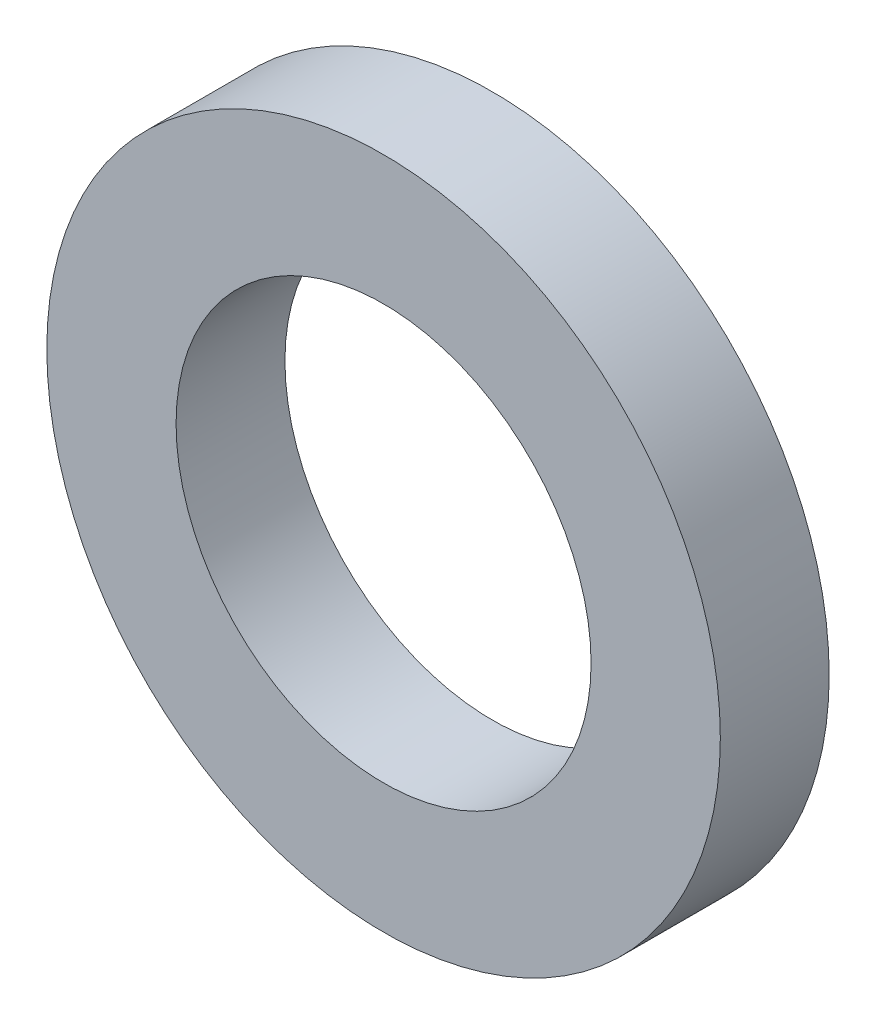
from build123d import *

# Parameters (mm, degrees)
SKETCH1_R           = 4.95
SKETCH1_R_2         = 3.05
BOSS_EXTRUDE1_DEPTH = 1.6


with BuildPart() as part:
    # Sketch1 → Boss-Extrude1 (new body)
    with BuildSketch(Plane.XY):
        Circle(SKETCH1_R)
        Circle(SKETCH1_R_2, mode=Mode.SUBTRACT)
    extrude(amount=-BOSS_EXTRUDE1_DEPTH)


solid = part.part
